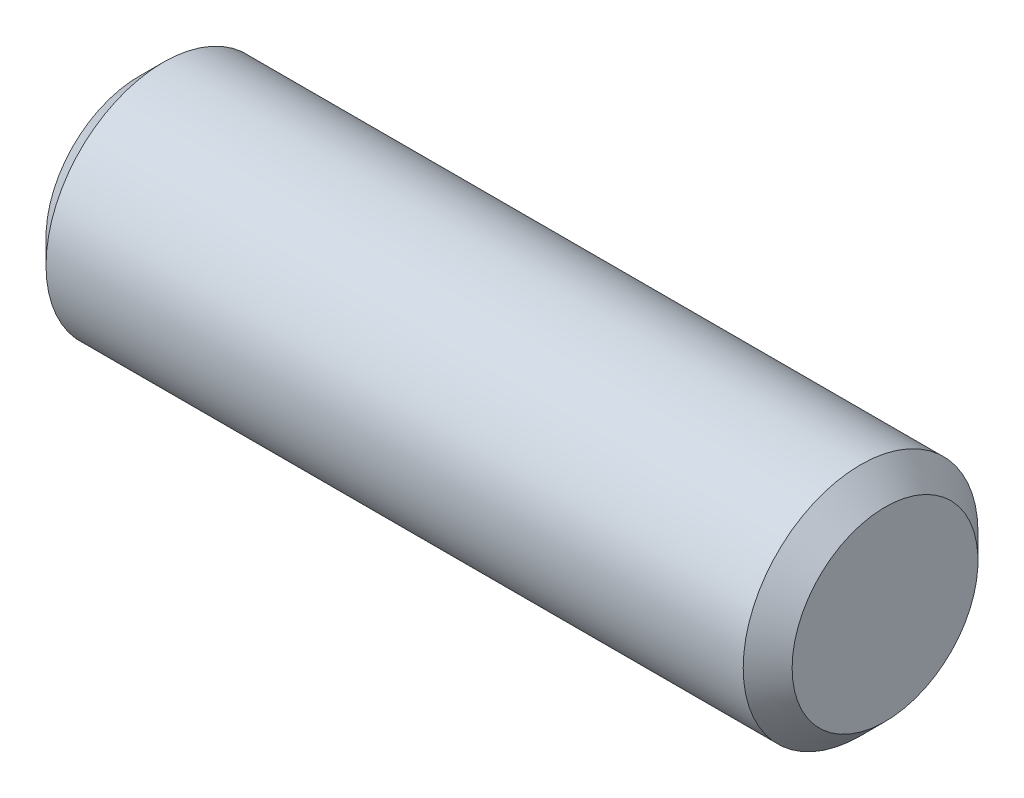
ISO-10303-21;
HEADER;
FILE_DESCRIPTION(('STEP AP214'),'2;1');
FILE_NAME('part.step','',(''),(''),'','','');
FILE_SCHEMA(('AUTOMOTIVE_DESIGN { 1 0 10303 214 1 1 1 1 }'));
ENDSEC;
DATA;
#1=APPLICATION_CONTEXT('core data for automotive mechanical design processes');
#2=APPLICATION_PROTOCOL_DEFINITION('international standard','automotive_design',2000,#1);
#3=PRODUCT_CONTEXT('',#1,'mechanical');
#4=PRODUCT('Part','Part','',(#3));
#5=PRODUCT_RELATED_PRODUCT_CATEGORY('part','',(#4));
#6=PRODUCT_DEFINITION_FORMATION('','',#4);
#7=PRODUCT_DEFINITION_CONTEXT('part definition',#1,'design');
#8=PRODUCT_DEFINITION('design','',#6,#7);
#9=PRODUCT_DEFINITION_SHAPE('','',#8);
#10=(LENGTH_UNIT() NAMED_UNIT(*) SI_UNIT(.MILLI.,.METRE.));
#11=(NAMED_UNIT(*) PLANE_ANGLE_UNIT() SI_UNIT($,.RADIAN.));
#12=(NAMED_UNIT(*) SI_UNIT($,.STERADIAN.) SOLID_ANGLE_UNIT());
#13=UNCERTAINTY_MEASURE_WITH_UNIT(LENGTH_MEASURE(1.E-05),#10,'distance_accuracy_value','');
#14=(GEOMETRIC_REPRESENTATION_CONTEXT(3) GLOBAL_UNCERTAINTY_ASSIGNED_CONTEXT((#13)) GLOBAL_UNIT_ASSIGNED_CONTEXT((#10,
#11,#12)) REPRESENTATION_CONTEXT('',''));
#15=CARTESIAN_POINT('',(0.,0.,0.));
#16=DIRECTION('',(0.,0.,1.));
#17=DIRECTION('',(1.,0.,0.));
#18=AXIS2_PLACEMENT_3D('',#15,#16,#17);
#19=CARTESIAN_POINT('',(0.,1.219,0.));
#20=DIRECTION('',(1.,0.,0.));
#21=DIRECTION('',(0.,0.,-1.));
#22=AXIS2_PLACEMENT_3D('',#19,#20,#21);
#23=PLANE('',#22);
#24=CARTESIAN_POINT('',(0.,0.,0.));
#25=DIRECTION('',(1.,0.,0.));
#26=DIRECTION('',(0.,0.,-1.));
#27=AXIS2_PLACEMENT_3D('',#24,#25,#26);
#28=CIRCLE('',#27,0.965000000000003);
#29=CARTESIAN_POINT('',(0.,0.,-0.965000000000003));
#30=VERTEX_POINT('',#29);
#31=EDGE_CURVE('E10',#30,#30,#28,.F.);
#32=ORIENTED_EDGE('',*,*,#31,.T.);
#33=EDGE_LOOP('',(#32));
#34=FACE_BOUND('',#33,.T.);
#35=ADVANCED_FACE('F29',(#34),#23,.F.);
#36=CARTESIAN_POINT('',(7.747,0.,0.));
#37=DIRECTION('',(-1.,0.,0.));
#38=DIRECTION('',(0.,0.,1.));
#39=AXIS2_PLACEMENT_3D('',#36,#37,#38);
#40=PLANE('',#39);
#41=CARTESIAN_POINT('',(7.747,0.,0.));
#42=DIRECTION('',(-1.,0.,0.));
#43=DIRECTION('',(0.,0.,1.));
#44=AXIS2_PLACEMENT_3D('',#41,#42,#43);
#45=CIRCLE('',#44,0.964999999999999);
#46=CARTESIAN_POINT('',(7.747,0.,0.964999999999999));
#47=VERTEX_POINT('',#46);
#48=EDGE_CURVE('E36',#47,#47,#45,.F.);
#49=ORIENTED_EDGE('',*,*,#48,.T.);
#50=EDGE_LOOP('',(#49));
#51=FACE_BOUND('',#50,.T.);
#52=ADVANCED_FACE('F60',(#51),#40,.F.);
#53=CARTESIAN_POINT('',(0.,0.,0.));
#54=DIRECTION('',(-1.,0.,0.));
#55=DIRECTION('',(0.,0.,1.));
#56=AXIS2_PLACEMENT_3D('',#53,#54,#55);
#57=CYLINDRICAL_SURFACE('',#56,1.219);
#58=CARTESIAN_POINT('',(7.493,0.,0.));
#59=DIRECTION('',(-1.,0.,0.));
#60=DIRECTION('',(0.,0.,1.));
#61=AXIS2_PLACEMENT_3D('',#58,#59,#60);
#62=CIRCLE('',#61,1.219);
#63=CARTESIAN_POINT('',(7.493,0.,1.219));
#64=VERTEX_POINT('',#63);
#65=EDGE_CURVE('E40',#64,#64,#62,.T.);
#66=ORIENTED_EDGE('',*,*,#65,.T.);
#67=EDGE_LOOP('',(#66));
#68=FACE_BOUND('',#67,.T.);
#69=CARTESIAN_POINT('',(0.254000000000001,0.,0.));
#70=DIRECTION('',(1.,0.,0.));
#71=DIRECTION('',(0.,0.,-1.));
#72=AXIS2_PLACEMENT_3D('',#69,#70,#71);
#73=CIRCLE('',#72,1.219);
#74=CARTESIAN_POINT('',(0.254000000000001,0.,-1.219));
#75=VERTEX_POINT('',#74);
#76=EDGE_CURVE('E44',#75,#75,#73,.T.);
#77=ORIENTED_EDGE('',*,*,#76,.T.);
#78=EDGE_LOOP('',(#77));
#79=FACE_BOUND('',#78,.T.);
#80=ADVANCED_FACE('F50',(#68,#79),#57,.T.);
#81=CARTESIAN_POINT('',(7.493,0.,0.));
#82=DIRECTION('',(-1.,0.,0.));
#83=DIRECTION('',(0.,0.,1.));
#84=AXIS2_PLACEMENT_3D('',#81,#82,#83);
#85=CONICAL_SURFACE('',#84,1.219,0.785398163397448);
#86=ORIENTED_EDGE('',*,*,#48,.F.);
#87=EDGE_LOOP('',(#86));
#88=FACE_BOUND('',#87,.T.);
#89=ORIENTED_EDGE('',*,*,#65,.F.);
#90=EDGE_LOOP('',(#89));
#91=FACE_BOUND('',#90,.T.);
#92=ADVANCED_FACE('F54',(#88,#91),#85,.T.);
#93=CARTESIAN_POINT('',(0.,0.,0.));
#94=DIRECTION('',(1.,0.,0.));
#95=DIRECTION('',(0.,0.,-1.));
#96=AXIS2_PLACEMENT_3D('',#93,#94,#95);
#97=CONICAL_SURFACE('',#96,0.965000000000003,0.785398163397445);
#98=ORIENTED_EDGE('',*,*,#76,.F.);
#99=EDGE_LOOP('',(#98));
#100=FACE_BOUND('',#99,.T.);
#101=ORIENTED_EDGE('',*,*,#31,.F.);
#102=EDGE_LOOP('',(#101));
#103=FACE_BOUND('',#102,.T.);
#104=ADVANCED_FACE('F31',(#100,#103),#97,.T.);
#105=CLOSED_SHELL('',(#35,#52,#80,#92,#104));
#106=MANIFOLD_SOLID_BREP('B2',#105);
#107=ADVANCED_BREP_SHAPE_REPRESENTATION('',(#18,#106),#14);
#108=SHAPE_DEFINITION_REPRESENTATION(#9,#107);
ENDSEC;
END-ISO-10303-21;
